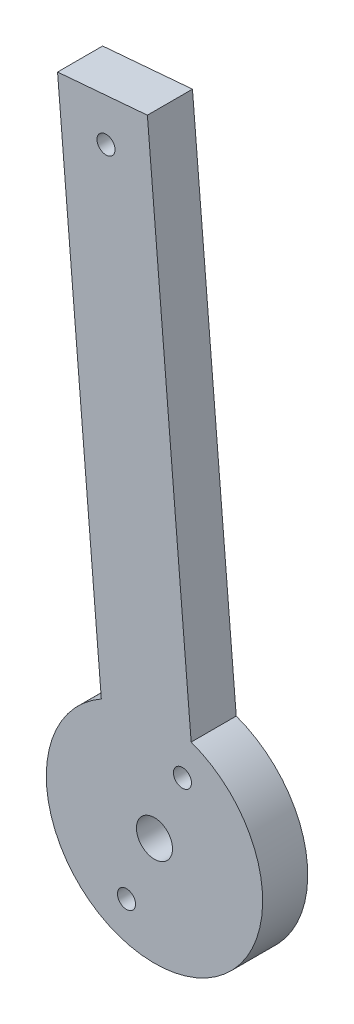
from build123d import *

# Parameters (mm, degrees)
BOSS_EXTRUDE1_DEPTH = 5
SKETCH2_R           = 2
SKETCH2_R_2         = 1
CUT_EXTRUDE1_DEPTH  = 5
SKETCH3_R           = 1
CUT_EXTRUDE2_DEPTH  = 10


with BuildPart() as part:
    # Sketch1 → Boss-Extrude1 (new body)
    with BuildSketch(Plane.XY):
        with BuildLine():
            Line((-5.895792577, 10.451776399), (-10.751931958, 68.248124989))
            Line((-10.751931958, 68.248124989), (-0.78704427, 69.085390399))
            Line((-0.78704427, 69.085390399), (4.069095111, 11.289041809))
            ThreePointArc((4.069095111, 11.289041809), (1.004718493, -11.957865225), (-5.895792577, 10.451776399))
        make_face()
    extrude(amount=BOSS_EXTRUDE1_DEPTH)

    # Sketch2 → Cut-Extrude1 (cut)
    with BuildSketch(Plane.XY.offset(5)):
        Circle(SKETCH2_R)
        with Locations((-5.374793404, 63.96921685)):
            Circle(SKETCH2_R_2)
    extrude(amount=-CUT_EXTRUDE1_DEPTH, mode=Mode.SUBTRACT)

    # Sketch3 → Cut-Extrude2 (cut)
    with BuildSketch(Plane.XY.offset(5)):
        with Locations((3.104667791, 7.372993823)):
            Circle(SKETCH3_R)
        with Locations((-3.104667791, -7.372993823)):
            Circle(SKETCH3_R)
    extrude(amount=-CUT_EXTRUDE2_DEPTH, mode=Mode.SUBTRACT)


solid = part.part
